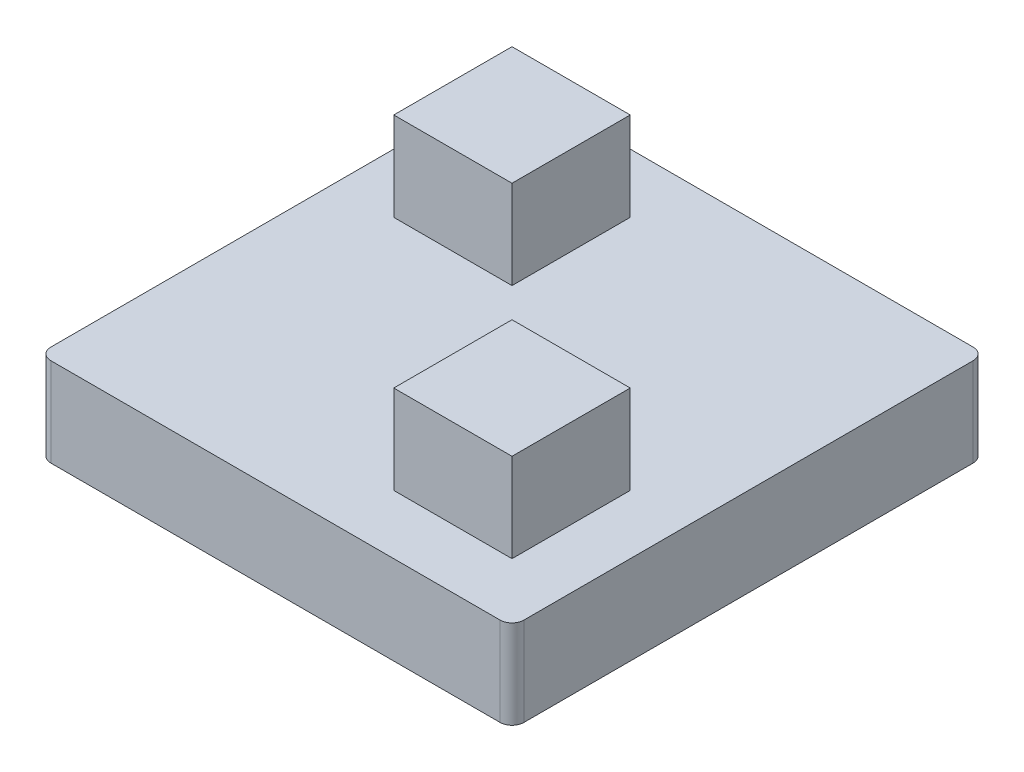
from build123d import *

# Parameters (mm, degrees)
BASE_SKETCH_2_W   = 101.6
BASE_SKETCH_2_H   = 101.6
BASE_SKETCH_DEPTH = 19.05
BOSS_1_SKETCH_W   = 25.4
BOSS_1_SKETCH_H   = 25.4
EXTRUDE2_DEPTH    = 19.05
SKETCH3_W         = 25.4
SKETCH3_H         = 25.4
EXTRUDE3_DEPTH    = 19.05
FILLET2_R         = 2.54


with BuildPart() as part:
    # Base Sketch 2 → Base Sketch (new body)
    with BuildSketch(Plane(origin=(0, 0, 0), x_dir=(1, 0, 0), z_dir=(0, 1, 0))):
        Rectangle(BASE_SKETCH_2_W, BASE_SKETCH_2_H)
    extrude(amount=BASE_SKETCH_DEPTH)

    # Boss 1 Sketch → Extrude2 (add)
    with BuildSketch(Plane(origin=(0, 19.05, 0), x_dir=(-1, 0, 0), z_dir=(0, 1, 0))):
        with Locations((-25.4, 25.4)):
            Rectangle(BOSS_1_SKETCH_W, BOSS_1_SKETCH_H)
    extrude(amount=EXTRUDE2_DEPTH)

    # Sketch3 → Extrude3 (add)
    with BuildSketch(Plane(origin=(0, 19.05, 0), x_dir=(-1, 0, 0), z_dir=(0, 1, 0))):
        with Locations((25.4, -25.4)):
            Rectangle(SKETCH3_W, SKETCH3_H)
    extrude(amount=EXTRUDE3_DEPTH)

    # Fillet2
    fillet2_edges = [part.edges().sort_by_distance(p)[0] for p in [
        (-50.8, 9.525, -50.8),
        (50.8, 9.525, -50.8),
        (50.8, 9.525, 50.8),
        (-50.8, 9.525, 50.8),
    ]]
    fillet(fillet2_edges, radius=FILLET2_R)


solid = part.part
